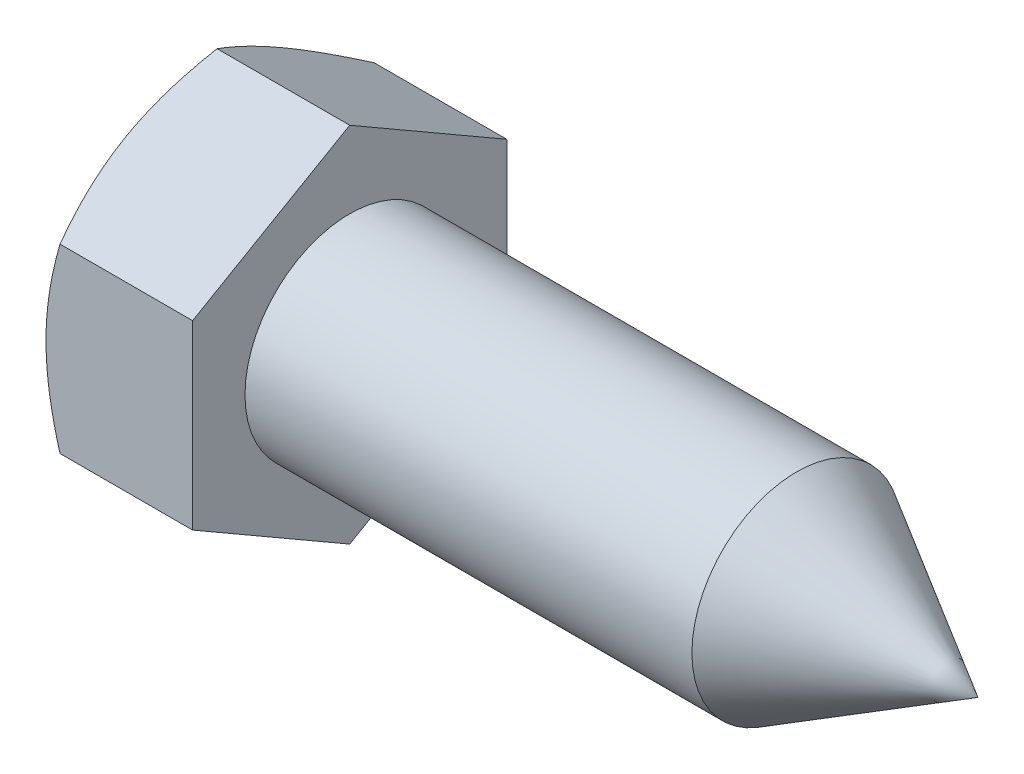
ISO-10303-21;
HEADER;
FILE_DESCRIPTION(('STEP AP214'),'2;1');
FILE_NAME('part.step','',(''),(''),'','','');
FILE_SCHEMA(('AUTOMOTIVE_DESIGN { 1 0 10303 214 1 1 1 1 }'));
ENDSEC;
DATA;
#1=APPLICATION_CONTEXT('core data for automotive mechanical design processes');
#2=APPLICATION_PROTOCOL_DEFINITION('international standard','automotive_design',2000,#1);
#3=PRODUCT_CONTEXT('',#1,'mechanical');
#4=PRODUCT('Part','Part','',(#3));
#5=PRODUCT_RELATED_PRODUCT_CATEGORY('part','',(#4));
#6=PRODUCT_DEFINITION_FORMATION('','',#4);
#7=PRODUCT_DEFINITION_CONTEXT('part definition',#1,'design');
#8=PRODUCT_DEFINITION('design','',#6,#7);
#9=PRODUCT_DEFINITION_SHAPE('','',#8);
#10=(LENGTH_UNIT() NAMED_UNIT(*) SI_UNIT(.MILLI.,.METRE.));
#11=(NAMED_UNIT(*) PLANE_ANGLE_UNIT() SI_UNIT($,.RADIAN.));
#12=(NAMED_UNIT(*) SI_UNIT($,.STERADIAN.) SOLID_ANGLE_UNIT());
#13=UNCERTAINTY_MEASURE_WITH_UNIT(LENGTH_MEASURE(1.E-05),#10,'distance_accuracy_value','');
#14=(GEOMETRIC_REPRESENTATION_CONTEXT(3) GLOBAL_UNCERTAINTY_ASSIGNED_CONTEXT((#13)) GLOBAL_UNIT_ASSIGNED_CONTEXT((#10,
#11,#12)) REPRESENTATION_CONTEXT('',''));
#15=CARTESIAN_POINT('',(0.,0.,0.));
#16=DIRECTION('',(0.,0.,1.));
#17=DIRECTION('',(1.,0.,0.));
#18=AXIS2_PLACEMENT_3D('',#15,#16,#17);
#19=CARTESIAN_POINT('',(17.78,10.9985226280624,-19.05));
#20=DIRECTION('',(0.,-0.866025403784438,0.500000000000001));
#21=DIRECTION('',(0.,-0.500000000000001,-0.866025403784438));
#22=AXIS2_PLACEMENT_3D('',#19,#20,#21);
#23=PLANE('',#22);
#24=CARTESIAN_POINT('',(1.70154403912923,21.9971607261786,0.000200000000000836));
#25=CARTESIAN_POINT('',(1.56198341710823,21.7554177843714,-0.41851105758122));
#26=CARTESIAN_POINT('',(1.42875584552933,21.5127319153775,-0.838855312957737));
#27=CARTESIAN_POINT('',(1.17672716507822,21.0254141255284,-1.68291448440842));
#28=CARTESIAN_POINT('',(1.05793080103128,20.7807815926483,-2.10663046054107));
#29=CARTESIAN_POINT('',(0.836361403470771,20.2890976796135,-2.95825197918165));
#30=CARTESIAN_POINT('',(0.733626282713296,20.0420419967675,-3.38616497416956));
#31=CARTESIAN_POINT('',(0.546385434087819,19.5462139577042,-4.24496432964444));
#32=CARTESIAN_POINT('',(0.461878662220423,19.2974417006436,-4.67585051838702));
#33=CARTESIAN_POINT('',(0.314688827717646,18.8045548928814,-5.5295555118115));
#34=CARTESIAN_POINT('',(0.251518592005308,18.5604769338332,-5.95231093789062));
#35=CARTESIAN_POINT('',(0.145596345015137,18.0712026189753,-6.79975891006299));
#36=CARTESIAN_POINT('',(0.102844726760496,17.8260062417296,-7.22445149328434));
#37=CARTESIAN_POINT('',(0.0388391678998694,17.3352016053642,-8.07455006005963));
#38=CARTESIAN_POINT('',(0.0175596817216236,17.0895941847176,-8.49995459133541));
#39=CARTESIAN_POINT('',(-0.003043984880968,16.5981526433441,-9.3511563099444));
#40=CARTESIAN_POINT('',(-0.00236884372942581,16.3523185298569,-9.77695348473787));
#41=CARTESIAN_POINT('',(0.0194033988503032,15.8927264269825,-10.5729903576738));
#42=CARTESIAN_POINT('',(0.0378455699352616,15.6789356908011,-10.9432867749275));
#43=CARTESIAN_POINT('',(0.0909844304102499,15.2518641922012,-11.6829963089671));
#44=CARTESIAN_POINT('',(0.125680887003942,15.0385834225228,-12.0524094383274));
#45=CARTESIAN_POINT('',(0.210726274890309,14.612612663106,-12.7902124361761));
#46=CARTESIAN_POINT('',(0.261089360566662,14.3999233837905,-13.1586010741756));
#47=CARTESIAN_POINT('',(0.376579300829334,13.9755573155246,-13.8936246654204));
#48=CARTESIAN_POINT('',(0.441706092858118,13.7638805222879,-14.2602596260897));
#49=CARTESIAN_POINT('',(0.660888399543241,13.121308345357,-15.3732272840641));
#50=CARTESIAN_POINT('',(0.836799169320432,12.6922737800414,-16.116336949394));
#51=CARTESIAN_POINT('',(1.23604434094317,11.840601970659,-17.5914757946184));
#52=CARTESIAN_POINT('',(1.4592849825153,11.4179538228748,-18.3235238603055));
#53=CARTESIAN_POINT('',(1.70154403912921,10.9984071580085,-19.0502));
#54=B_SPLINE_CURVE_WITH_KNOTS('',3,(#24,#25,#26,#27,#28,#29,#30,#31,#32,#33,#34,#35,#36,#37,#38,
#39,#40,#41,#42,#43,#44,#45,#46,#47,#48,#49,#50,#51,#52,#53),.UNSPECIFIED.,.F.,.F.,(4,2,2,2,2,2,
2,2,2,2,2,2,2,2,4),(0.,1.50971559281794,3.01992622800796,4.53364959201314,6.04728623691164,
7.52356313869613,8.99986845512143,10.4744153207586,11.9489166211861,13.2325441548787,
14.5161533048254,15.8009255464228,17.085692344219,19.7118183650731,22.3327898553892),.UNSPECIFIED.);
#55=CARTESIAN_POINT('',(1.70147737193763,21.9970452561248,0.));
#56=VERTEX_POINT('',#55);
#57=CARTESIAN_POINT('',(0.,16.4977839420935,-9.52500000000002));
#58=VERTEX_POINT('',#57);
#59=EDGE_CURVE('E59',#56,#58,#54,.T.);
#60=ORIENTED_EDGE('',*,*,#59,.F.);
#61=DIRECTION('',(-1.,0.,0.));
#62=VECTOR('',#61,1.);
#63=CARTESIAN_POINT('',(17.78,21.9970452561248,0.));
#64=LINE('',#63,#62);
#65=CARTESIAN_POINT('',(17.78,21.9970452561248,0.));
#66=VERTEX_POINT('',#65);
#67=EDGE_CURVE('E170',#66,#56,#64,.T.);
#68=ORIENTED_EDGE('',*,*,#67,.F.);
#69=DIRECTION('',(0.,0.500000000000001,0.866025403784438));
#70=VECTOR('',#69,1.);
#71=CARTESIAN_POINT('',(17.78,10.9985226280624,-19.05));
#72=LINE('',#71,#70);
#73=CARTESIAN_POINT('',(17.78,10.9985226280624,-19.05));
#74=VERTEX_POINT('',#73);
#75=EDGE_CURVE('E290',#74,#66,#72,.T.);
#76=ORIENTED_EDGE('',*,*,#75,.F.);
#77=DIRECTION('',(-1.,0.,0.));
#78=VECTOR('',#77,1.);
#79=CARTESIAN_POINT('',(17.78,10.9985226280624,-19.05));
#80=LINE('',#79,#78);
#81=CARTESIAN_POINT('',(1.70147737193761,10.9985226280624,-19.05));
#82=VERTEX_POINT('',#81);
#83=EDGE_CURVE('E147',#74,#82,#80,.T.);
#84=ORIENTED_EDGE('',*,*,#83,.T.);
#85=EDGE_CURVE('E142',#58,#82,#54,.T.);
#86=ORIENTED_EDGE('',*,*,#85,.F.);
#87=EDGE_LOOP('',(#60,#68,#76,#84,#86));
#88=FACE_BOUND('',#87,.T.);
#89=ADVANCED_FACE('F41',(#88),#23,.F.);
#90=CARTESIAN_POINT('',(17.78,21.9970452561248,0.));
#91=DIRECTION('',(0.,-0.866025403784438,-0.500000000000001));
#92=DIRECTION('',(0.,0.500000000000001,-0.866025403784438));
#93=AXIS2_PLACEMENT_3D('',#90,#91,#92);
#94=PLANE('',#93);
#95=CARTESIAN_POINT('',(1.70154403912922,10.9984071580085,19.0502));
#96=CARTESIAN_POINT('',(1.56198341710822,11.2401500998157,18.6314889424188));
#97=CARTESIAN_POINT('',(1.42875584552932,11.4828359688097,18.2111446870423));
#98=CARTESIAN_POINT('',(1.17672716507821,11.9701537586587,17.3670855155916));
#99=CARTESIAN_POINT('',(1.05793080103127,12.2147862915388,16.9433695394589));
#100=CARTESIAN_POINT('',(0.836361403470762,12.7064702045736,16.0917480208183));
#101=CARTESIAN_POINT('',(0.733626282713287,12.9535258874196,15.6638350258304));
#102=CARTESIAN_POINT('',(0.546385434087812,13.4493539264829,14.8050356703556));
#103=CARTESIAN_POINT('',(0.461878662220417,13.6981261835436,14.374149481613));
#104=CARTESIAN_POINT('',(0.314688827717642,14.1910129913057,13.5204444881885));
#105=CARTESIAN_POINT('',(0.251518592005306,14.4350909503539,13.0976890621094));
#106=CARTESIAN_POINT('',(0.145596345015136,14.9243652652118,12.250241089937));
#107=CARTESIAN_POINT('',(0.102844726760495,15.1695616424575,11.8255485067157));
#108=CARTESIAN_POINT('',(0.0388391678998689,15.6603662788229,10.9754499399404));
#109=CARTESIAN_POINT('',(0.0175596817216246,15.9059736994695,10.5500454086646));
#110=CARTESIAN_POINT('',(-0.00304398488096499,16.397415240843,9.69884369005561));
#111=CARTESIAN_POINT('',(-0.00236884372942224,16.6432493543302,9.27304651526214));
#112=CARTESIAN_POINT('',(0.0194033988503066,17.1028414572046,8.47700964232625));
#113=CARTESIAN_POINT('',(0.0378455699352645,17.316632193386,8.10671322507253));
#114=CARTESIAN_POINT('',(0.0909844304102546,17.7437036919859,7.36700369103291));
#115=CARTESIAN_POINT('',(0.125680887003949,17.9569844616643,6.99759056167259));
#116=CARTESIAN_POINT('',(0.210726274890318,18.3829552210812,6.25978756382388));
#117=CARTESIAN_POINT('',(0.26108936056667,18.5956445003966,5.89139892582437));
#118=CARTESIAN_POINT('',(0.376579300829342,19.0200105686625,5.15637533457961));
#119=CARTESIAN_POINT('',(0.441706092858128,19.2316873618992,4.7897403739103));
#120=CARTESIAN_POINT('',(0.660888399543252,19.8742595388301,3.67677271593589));
#121=CARTESIAN_POINT('',(0.836799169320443,20.3032941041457,2.93366305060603));
#122=CARTESIAN_POINT('',(1.23604434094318,21.1549659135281,1.45852420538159));
#123=CARTESIAN_POINT('',(1.45928498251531,21.5776140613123,0.726476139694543));
#124=CARTESIAN_POINT('',(1.70154403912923,21.9971607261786,-0.000199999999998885));
#125=B_SPLINE_CURVE_WITH_KNOTS('',3,(#95,#96,#97,#98,#99,#100,#101,#102,#103,#104,#105,#106,
#107,#108,#109,#110,#111,#112,#113,#114,#115,#116,#117,#118,#119,#120,#121,#122,#123,#124),
.UNSPECIFIED.,.F.,.F.,(4,2,2,2,2,2,2,2,2,2,2,2,2,2,4),(0.,1.50971559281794,3.01992622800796,
4.53364959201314,6.04728623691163,7.52356313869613,8.99986845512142,10.4744153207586,
11.9489166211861,13.2325441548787,14.5161533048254,15.8009255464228,17.085692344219,
19.7118183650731,22.3327898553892),.UNSPECIFIED.);
#126=CARTESIAN_POINT('',(1.70147737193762,10.9985226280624,19.05));
#127=VERTEX_POINT('',#126);
#128=CARTESIAN_POINT('',(0.,16.4977839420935,9.52500000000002));
#129=VERTEX_POINT('',#128);
#130=EDGE_CURVE('E61',#127,#129,#125,.T.);
#131=ORIENTED_EDGE('',*,*,#130,.F.);
#132=DIRECTION('',(-1.,0.,0.));
#133=VECTOR('',#132,1.);
#134=CARTESIAN_POINT('',(17.78,10.9985226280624,19.05));
#135=LINE('',#134,#133);
#136=CARTESIAN_POINT('',(17.78,10.9985226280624,19.05));
#137=VERTEX_POINT('',#136);
#138=EDGE_CURVE('E165',#137,#127,#135,.T.);
#139=ORIENTED_EDGE('',*,*,#138,.F.);
#140=DIRECTION('',(0.,-0.500000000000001,0.866025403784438));
#141=VECTOR('',#140,1.);
#142=CARTESIAN_POINT('',(17.78,21.9970452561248,0.));
#143=LINE('',#142,#141);
#144=EDGE_CURVE('E283',#66,#137,#143,.T.);
#145=ORIENTED_EDGE('',*,*,#144,.F.);
#146=ORIENTED_EDGE('',*,*,#67,.T.);
#147=EDGE_CURVE('E198',#129,#56,#125,.T.);
#148=ORIENTED_EDGE('',*,*,#147,.F.);
#149=EDGE_LOOP('',(#131,#139,#145,#146,#148));
#150=FACE_BOUND('',#149,.T.);
#151=ADVANCED_FACE('F207',(#150),#94,.F.);
#152=CARTESIAN_POINT('',(17.78,10.9985226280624,19.05));
#153=DIRECTION('',(0.,0.,-1.));
#154=DIRECTION('',(-1.,0.,0.));
#155=AXIS2_PLACEMENT_3D('',#152,#153,#154);
#156=PLANE('',#155);
#157=CARTESIAN_POINT('',(9.36387045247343,-29.681284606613,19.05));
#158=CARTESIAN_POINT('',(9.16146582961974,-29.264706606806,19.05));
#159=CARTESIAN_POINT('',(8.96006010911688,-28.8476434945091,19.05));
#160=CARTESIAN_POINT('',(8.55947242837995,-28.0124458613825,19.05));
#161=CARTESIAN_POINT('',(8.36029049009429,-27.5943113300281,19.05));
#162=CARTESIAN_POINT('',(7.76636768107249,-26.3380393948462,19.05));
#163=CARTESIAN_POINT('',(7.37530881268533,-25.4981547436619,19.05));
#164=CARTESIAN_POINT('',(6.60327220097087,-23.808305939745,19.05));
#165=CARTESIAN_POINT('',(6.22235974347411,-22.9583118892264,19.05));
#166=CARTESIAN_POINT('',(5.47593301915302,-21.2516124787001,19.05));
#167=CARTESIAN_POINT('',(5.11041803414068,-20.3949074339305,19.05));
#168=CARTESIAN_POINT('',(4.38719116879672,-18.6452025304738,19.05));
#169=CARTESIAN_POINT('',(4.03012757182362,-17.7519333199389,19.05));
#170=CARTESIAN_POINT('',(3.34269044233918,-15.9549889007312,19.05));
#171=CARTESIAN_POINT('',(3.01231988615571,-15.0513125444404,19.05));
#172=CARTESIAN_POINT('',(2.38684616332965,-13.2337927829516,19.05));
#173=CARTESIAN_POINT('',(2.09167277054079,-12.3199737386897,19.05));
#174=CARTESIAN_POINT('',(1.54595671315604,-10.4791413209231,19.05));
#175=CARTESIAN_POINT('',(1.29540013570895,-9.5521321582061,19.05));
#176=CARTESIAN_POINT('',(0.962715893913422,-8.15413474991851,19.05));
#177=CARTESIAN_POINT('',(0.859241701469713,-7.68819648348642,19.05));
#178=CARTESIAN_POINT('',(0.667894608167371,-6.75311076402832,19.05));
#179=CARTESIAN_POINT('',(0.580021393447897,-6.28396337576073,19.05));
#180=CARTESIAN_POINT('',(0.421420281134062,-5.34278179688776,19.05));
#181=CARTESIAN_POINT('',(0.350691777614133,-4.87074770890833,19.05));
#182=CARTESIAN_POINT('',(0.227781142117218,-3.92425443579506,19.05));
#183=CARTESIAN_POINT('',(0.175598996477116,-3.44979525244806,19.05));
#184=CARTESIAN_POINT('',(0.0914843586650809,-2.50539642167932,19.05));
#185=CARTESIAN_POINT('',(0.0592932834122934,-2.03547994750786,19.05));
#186=CARTESIAN_POINT('',(0.0148196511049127,-1.09470720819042,19.05));
#187=CARTESIAN_POINT('',(0.00253675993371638,-0.623850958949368,19.05));
#188=CARTESIAN_POINT('',(-0.00182781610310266,0.317959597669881,19.05));
#189=CARTESIAN_POINT('',(0.00609054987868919,0.788913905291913,19.05));
#190=CARTESIAN_POINT('',(0.0419336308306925,1.73006593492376,19.05));
#191=CARTESIAN_POINT('',(0.0698592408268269,2.20026362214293,19.05));
#192=CARTESIAN_POINT('',(0.160085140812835,3.32615149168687,19.05));
#193=CARTESIAN_POINT('',(0.231647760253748,3.9811127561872,19.05));
#194=CARTESIAN_POINT('',(0.409728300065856,5.2862687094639,19.05));
#195=CARTESIAN_POINT('',(0.516250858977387,5.93646275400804,19.05));
#196=CARTESIAN_POINT('',(0.76046212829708,7.23143263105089,19.05));
#197=CARTESIAN_POINT('',(0.898174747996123,7.87620391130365,19.05));
#198=CARTESIAN_POINT('',(1.20055584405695,9.159324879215,19.05));
#199=CARTESIAN_POINT('',(1.36522394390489,9.79767465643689,19.05));
#200=CARTESIAN_POINT('',(1.7214113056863,11.0820581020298,19.05));
#201=CARTESIAN_POINT('',(1.91344522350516,11.7279480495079,19.05));
#202=CARTESIAN_POINT('',(2.31762854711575,13.0133672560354,19.05));
#203=CARTESIAN_POINT('',(2.52977808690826,13.6528964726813,19.05));
#204=CARTESIAN_POINT('',(2.97080026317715,14.9259053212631,19.05));
#205=CARTESIAN_POINT('',(3.19966751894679,15.5593868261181,19.05));
#206=CARTESIAN_POINT('',(3.67140574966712,16.8210826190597,19.05));
#207=CARTESIAN_POINT('',(3.91427655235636,17.4492969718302,19.05));
#208=CARTESIAN_POINT('',(4.50783243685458,18.9429543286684,19.05));
#209=CARTESIAN_POINT('',(4.86391009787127,19.8062512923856,19.05));
#210=CARTESIAN_POINT('',(5.59369975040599,21.5253820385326,19.05));
#211=CARTESIAN_POINT('',(5.96741288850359,22.3812153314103,19.05));
#212=CARTESIAN_POINT('',(6.72890710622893,24.0868250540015,19.05));
#213=CARTESIAN_POINT('',(7.11669148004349,24.9366000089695,19.05));
#214=CARTESIAN_POINT('',(7.90345923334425,26.63091294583,19.05));
#215=CARTESIAN_POINT('',(8.3024423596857,27.4754510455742,19.05));
#216=CARTESIAN_POINT('',(9.1099521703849,29.161125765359,19.05));
#217=CARTESIAN_POINT('',(9.51848919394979,30.0022574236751,19.05));
#218=CARTESIAN_POINT('',(10.3430229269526,31.6808559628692,19.05));
#219=CARTESIAN_POINT('',(10.7590196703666,32.518322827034,19.05));
#220=CARTESIAN_POINT('',(11.5971269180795,34.1900490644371,19.05));
#221=CARTESIAN_POINT('',(12.0192366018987,35.0243088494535,19.05));
#222=CARTESIAN_POINT('',(12.8686125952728,36.690194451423,19.05));
#223=CARTESIAN_POINT('',(13.2958788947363,37.5218202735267,19.05));
#224=CARTESIAN_POINT('',(14.510917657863,39.8716762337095,19.05));
#225=CARTESIAN_POINT('',(15.3037675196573,41.3872809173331,19.05));
#226=CARTESIAN_POINT('',(16.9002701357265,44.4128482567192,19.05));
#227=CARTESIAN_POINT('',(17.7039232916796,45.9228107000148,19.05));
#228=CARTESIAN_POINT('',(19.3174048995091,48.9344252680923,19.05));
#229=CARTESIAN_POINT('',(20.1272121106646,50.4360887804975,19.05));
#230=CARTESIAN_POINT('',(21.3467150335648,52.6859282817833,19.05));
#231=CARTESIAN_POINT('',(21.7540032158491,53.4354111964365,19.05));
#232=CARTESIAN_POINT('',(22.5700166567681,54.9335928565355,19.05));
#233=CARTESIAN_POINT('',(22.9787419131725,55.6822916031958,19.05));
#234=CARTESIAN_POINT('',(23.3881024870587,56.4306429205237,19.05));
#235=B_SPLINE_CURVE_WITH_KNOTS('',3,(#157,#158,#159,#160,#161,#162,#163,#164,#165,#166,#167,
#168,#169,#170,#171,#172,#173,#174,#175,#176,#177,#178,#179,#180,#181,#182,#183,#184,#185,#186,
#187,#188,#189,#190,#191,#192,#193,#194,#195,#196,#197,#198,#199,#200,#201,#202,#203,#204,#205,
#206,#207,#208,#209,#210,#211,#212,#213,#214,#215,#216,#217,#218,#219,#220,#221,#222,#223,#224,
#225,#226,#227,#228,#229,#230,#231,#232,#233,#234),.UNSPECIFIED.,.F.,.F.,(4,2,2,2,2,2,2,2,2,2,2,
2,2,2,2,2,2,2,2,2,2,2,2,2,2,2,2,2,2,2,2,2,2,2,2,2,2,2,4),(0.,1.38943761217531,2.77888892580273,
5.55819563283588,8.35240254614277,11.1464789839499,14.0321224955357,16.9180873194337,
19.7981940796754,22.6774011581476,24.1090510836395,25.5406722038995,26.9722427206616,
28.4038121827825,29.8164561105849,31.2290763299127,32.6417001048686,34.0543870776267,
36.0298747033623,38.0056245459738,39.9828940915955,41.9601360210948,43.9812438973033,
46.0023652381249,48.0228389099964,50.0432877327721,52.8445655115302,55.6460256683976,
58.4481459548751,61.2502029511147,64.0554471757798,66.8607041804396,69.665588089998,
72.470466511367,77.6017760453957,82.7332768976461,87.8515588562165,90.4105564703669,
92.969550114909),.UNSPECIFIED.);
#236=CARTESIAN_POINT('',(1.70147737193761,-10.9985226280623,19.05));
#237=VERTEX_POINT('',#236);
#238=CARTESIAN_POINT('',(0.,0.,19.05));
#239=VERTEX_POINT('',#238);
#240=EDGE_CURVE('E298',#237,#239,#235,.T.);
#241=ORIENTED_EDGE('',*,*,#240,.F.);
#242=DIRECTION('',(-1.,0.,0.));
#243=VECTOR('',#242,1.);
#244=CARTESIAN_POINT('',(17.78,-10.9985226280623,19.05));
#245=LINE('',#244,#243);
#246=CARTESIAN_POINT('',(17.78,-10.9985226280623,19.05));
#247=VERTEX_POINT('',#246);
#248=EDGE_CURVE('E153',#247,#237,#245,.T.);
#249=ORIENTED_EDGE('',*,*,#248,.F.);
#250=DIRECTION('',(0.,-1.,0.));
#251=VECTOR('',#250,1.);
#252=CARTESIAN_POINT('',(17.78,10.9985226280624,19.05));
#253=LINE('',#252,#251);
#254=EDGE_CURVE('E280',#137,#247,#253,.T.);
#255=ORIENTED_EDGE('',*,*,#254,.F.);
#256=ORIENTED_EDGE('',*,*,#138,.T.);
#257=EDGE_CURVE('E227',#239,#127,#235,.T.);
#258=ORIENTED_EDGE('',*,*,#257,.F.);
#259=EDGE_LOOP('',(#241,#249,#255,#256,#258));
#260=FACE_BOUND('',#259,.T.);
#261=ADVANCED_FACE('F310',(#260),#156,.F.);
#262=CARTESIAN_POINT('',(17.78,-21.9970452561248,0.));
#263=DIRECTION('',(0.,0.866025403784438,-0.500000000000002));
#264=DIRECTION('',(0.,0.500000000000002,0.866025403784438));
#265=AXIS2_PLACEMENT_3D('',#262,#263,#264);
#266=PLANE('',#265);
#267=CARTESIAN_POINT('',(1.70154403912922,-21.9971607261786,-0.000200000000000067));
#268=CARTESIAN_POINT('',(1.56198341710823,-21.7554177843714,0.418511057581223));
#269=CARTESIAN_POINT('',(1.42875584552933,-21.5127319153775,0.838855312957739));
#270=CARTESIAN_POINT('',(1.17672716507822,-21.0254141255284,1.68291448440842));
#271=CARTESIAN_POINT('',(1.05793080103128,-20.7807815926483,2.10663046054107));
#272=CARTESIAN_POINT('',(0.836361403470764,-20.2890976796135,2.95825197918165));
#273=CARTESIAN_POINT('',(0.733626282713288,-20.0420419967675,3.38616497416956));
#274=CARTESIAN_POINT('',(0.546385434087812,-19.5462139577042,4.24496432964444));
#275=CARTESIAN_POINT('',(0.461878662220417,-19.2974417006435,4.67585051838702));
#276=CARTESIAN_POINT('',(0.31468882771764,-18.8045548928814,5.5295555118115));
#277=CARTESIAN_POINT('',(0.251518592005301,-18.5604769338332,5.95231093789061));
#278=CARTESIAN_POINT('',(0.145596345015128,-18.0712026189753,6.79975891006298));
#279=CARTESIAN_POINT('',(0.102844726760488,-17.8260062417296,7.22445149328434));
#280=CARTESIAN_POINT('',(0.0388391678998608,-17.3352016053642,8.07455006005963));
#281=CARTESIAN_POINT('',(0.0175596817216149,-17.0895941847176,8.49995459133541));
#282=CARTESIAN_POINT('',(-0.00304398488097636,-16.5981526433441,9.35115630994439));
#283=CARTESIAN_POINT('',(-0.00236884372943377,-16.3523185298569,9.77695348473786));
#284=CARTESIAN_POINT('',(0.0194033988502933,-15.8927264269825,10.5729903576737));
#285=CARTESIAN_POINT('',(0.0378455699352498,-15.6789356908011,10.9432867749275));
#286=CARTESIAN_POINT('',(0.0909844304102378,-15.2518641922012,11.6829963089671));
#287=CARTESIAN_POINT('',(0.125680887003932,-15.0385834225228,12.0524094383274));
#288=CARTESIAN_POINT('',(0.210726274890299,-14.6126126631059,12.7902124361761));
#289=CARTESIAN_POINT('',(0.261089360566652,-14.3999233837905,13.1586010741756));
#290=CARTESIAN_POINT('',(0.376579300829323,-13.9755573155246,13.8936246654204));
#291=CARTESIAN_POINT('',(0.441706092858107,-13.7638805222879,14.2602596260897));
#292=CARTESIAN_POINT('',(0.660888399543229,-13.121308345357,15.3732272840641));
#293=CARTESIAN_POINT('',(0.836799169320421,-12.6922737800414,16.116336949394));
#294=CARTESIAN_POINT('',(1.23604434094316,-11.840601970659,17.5914757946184));
#295=CARTESIAN_POINT('',(1.45928498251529,-11.4179538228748,18.3235238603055));
#296=CARTESIAN_POINT('',(1.7015440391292,-10.9984071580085,19.0502));
#297=B_SPLINE_CURVE_WITH_KNOTS('',3,(#267,#268,#269,#270,#271,#272,#273,#274,#275,#276,#277,
#278,#279,#280,#281,#282,#283,#284,#285,#286,#287,#288,#289,#290,#291,#292,#293,#294,#295,#296),
.UNSPECIFIED.,.F.,.F.,(4,2,2,2,2,2,2,2,2,2,2,2,2,2,4),(0.,1.50971559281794,3.01992622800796,
4.53364959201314,6.04728623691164,7.52356313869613,8.99986845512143,10.4744153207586,
11.9489166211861,13.2325441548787,14.5161533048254,15.8009255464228,17.085692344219,
19.7118183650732,22.3327898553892),.UNSPECIFIED.);
#298=CARTESIAN_POINT('',(1.70147737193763,-21.9970452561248,0.));
#299=VERTEX_POINT('',#298);
#300=CARTESIAN_POINT('',(0.,-16.4977839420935,9.52500000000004));
#301=VERTEX_POINT('',#300);
#302=EDGE_CURVE('E209',#299,#301,#297,.T.);
#303=ORIENTED_EDGE('',*,*,#302,.F.);
#304=DIRECTION('',(-1.,0.,0.));
#305=VECTOR('',#304,1.);
#306=CARTESIAN_POINT('',(17.78,-21.9970452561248,0.));
#307=LINE('',#306,#305);
#308=CARTESIAN_POINT('',(17.78,-21.9970452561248,0.));
#309=VERTEX_POINT('',#308);
#310=EDGE_CURVE('E149',#309,#299,#307,.T.);
#311=ORIENTED_EDGE('',*,*,#310,.F.);
#312=DIRECTION('',(0.,-0.500000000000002,-0.866025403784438));
#313=VECTOR('',#312,1.);
#314=CARTESIAN_POINT('',(17.78,-21.9970452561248,0.));
#315=LINE('',#314,#313);
#316=EDGE_CURVE('E273',#247,#309,#315,.T.);
#317=ORIENTED_EDGE('',*,*,#316,.F.);
#318=ORIENTED_EDGE('',*,*,#248,.T.);
#319=EDGE_CURVE('E212',#301,#237,#297,.T.);
#320=ORIENTED_EDGE('',*,*,#319,.F.);
#321=EDGE_LOOP('',(#303,#311,#317,#318,#320));
#322=FACE_BOUND('',#321,.T.);
#323=ADVANCED_FACE('F272',(#322),#266,.F.);
#324=CARTESIAN_POINT('',(17.78,-10.9985226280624,-19.05));
#325=DIRECTION('',(0.,0.866025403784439,0.5));
#326=DIRECTION('',(0.,-0.5,0.866025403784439));
#327=AXIS2_PLACEMENT_3D('',#324,#325,#326);
#328=PLANE('',#327);
#329=CARTESIAN_POINT('',(1.70154403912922,-10.9984071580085,-19.0502));
#330=CARTESIAN_POINT('',(1.56198341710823,-11.2401500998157,-18.6314889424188));
#331=CARTESIAN_POINT('',(1.42875584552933,-11.4828359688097,-18.2111446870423));
#332=CARTESIAN_POINT('',(1.17672716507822,-11.9701537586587,-17.3670855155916));
#333=CARTESIAN_POINT('',(1.05793080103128,-12.2147862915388,-16.9433695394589));
#334=CARTESIAN_POINT('',(0.836361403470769,-12.7064702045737,-16.0917480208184));
#335=CARTESIAN_POINT('',(0.733626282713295,-12.9535258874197,-15.6638350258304));
#336=CARTESIAN_POINT('',(0.54638543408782,-13.449353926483,-14.8050356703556));
#337=CARTESIAN_POINT('',(0.461878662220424,-13.6981261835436,-14.374149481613));
#338=CARTESIAN_POINT('',(0.314688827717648,-14.1910129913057,-13.5204444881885));
#339=CARTESIAN_POINT('',(0.251518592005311,-14.4350909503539,-13.0976890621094));
#340=CARTESIAN_POINT('',(0.145596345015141,-14.9243652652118,-12.250241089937));
#341=CARTESIAN_POINT('',(0.1028447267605,-15.1695616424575,-11.8255485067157));
#342=CARTESIAN_POINT('',(0.0388391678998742,-15.6603662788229,-10.9754499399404));
#343=CARTESIAN_POINT('',(0.01755968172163,-15.9059736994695,-10.5500454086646));
#344=CARTESIAN_POINT('',(-0.00304398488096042,-16.3974152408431,-9.6988436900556));
#345=CARTESIAN_POINT('',(-0.00236884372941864,-16.6432493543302,-9.27304651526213));
#346=CARTESIAN_POINT('',(0.01940339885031,-17.1028414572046,-8.47700964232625));
#347=CARTESIAN_POINT('',(0.0378455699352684,-17.316632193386,-8.10671322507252));
#348=CARTESIAN_POINT('',(0.0909844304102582,-17.7437036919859,-7.36700369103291));
#349=CARTESIAN_POINT('',(0.125680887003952,-17.9569844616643,-6.99759056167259));
#350=CARTESIAN_POINT('',(0.210726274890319,-18.3829552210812,-6.25978756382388));
#351=CARTESIAN_POINT('',(0.261089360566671,-18.5956445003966,-5.89139892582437));
#352=CARTESIAN_POINT('',(0.376579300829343,-19.0200105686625,-5.15637533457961));
#353=CARTESIAN_POINT('',(0.441706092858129,-19.2316873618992,-4.78974037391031));
#354=CARTESIAN_POINT('',(0.660888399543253,-19.8742595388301,-3.6767727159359));
#355=CARTESIAN_POINT('',(0.836799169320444,-20.3032941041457,-2.93366305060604));
#356=CARTESIAN_POINT('',(1.23604434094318,-21.1549659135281,-1.45852420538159));
#357=CARTESIAN_POINT('',(1.45928498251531,-21.5776140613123,-0.726476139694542));
#358=CARTESIAN_POINT('',(1.70154403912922,-21.9971607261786,0.000199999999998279));
#359=B_SPLINE_CURVE_WITH_KNOTS('',3,(#329,#330,#331,#332,#333,#334,#335,#336,#337,#338,#339,
#340,#341,#342,#343,#344,#345,#346,#347,#348,#349,#350,#351,#352,#353,#354,#355,#356,#357,#358),
.UNSPECIFIED.,.F.,.F.,(4,2,2,2,2,2,2,2,2,2,2,2,2,2,4),(0.,1.50971559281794,3.01992622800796,
4.53364959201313,6.04728623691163,7.52356313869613,8.99986845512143,10.4744153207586,
11.9489166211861,13.2325441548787,14.5161533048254,15.8009255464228,17.085692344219,
19.7118183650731,22.3327898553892),.UNSPECIFIED.);
#360=CARTESIAN_POINT('',(1.70147737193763,-10.9985226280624,-19.05));
#361=VERTEX_POINT('',#360);
#362=CARTESIAN_POINT('',(0.,-16.4977839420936,-9.525));
#363=VERTEX_POINT('',#362);
#364=EDGE_CURVE('E122',#361,#363,#359,.T.);
#365=ORIENTED_EDGE('',*,*,#364,.F.);
#366=DIRECTION('',(-1.,0.,0.));
#367=VECTOR('',#366,1.);
#368=CARTESIAN_POINT('',(17.78,-10.9985226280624,-19.05));
#369=LINE('',#368,#367);
#370=CARTESIAN_POINT('',(17.78,-10.9985226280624,-19.05));
#371=VERTEX_POINT('',#370);
#372=EDGE_CURVE('E138',#371,#361,#369,.T.);
#373=ORIENTED_EDGE('',*,*,#372,.F.);
#374=DIRECTION('',(0.,0.5,-0.866025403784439));
#375=VECTOR('',#374,1.);
#376=CARTESIAN_POINT('',(17.78,-10.9985226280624,-19.05));
#377=LINE('',#376,#375);
#378=EDGE_CURVE('E271',#309,#371,#377,.T.);
#379=ORIENTED_EDGE('',*,*,#378,.F.);
#380=ORIENTED_EDGE('',*,*,#310,.T.);
#381=EDGE_CURVE('E139',#363,#299,#359,.T.);
#382=ORIENTED_EDGE('',*,*,#381,.F.);
#383=EDGE_LOOP('',(#365,#373,#379,#380,#382));
#384=FACE_BOUND('',#383,.T.);
#385=ADVANCED_FACE('F133',(#384),#328,.F.);
#386=CARTESIAN_POINT('',(17.78,10.9985226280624,-19.05));
#387=DIRECTION('',(0.,0.,1.));
#388=DIRECTION('',(0.,-1.,0.));
#389=AXIS2_PLACEMENT_3D('',#386,#387,#388);
#390=PLANE('',#389);
#391=CARTESIAN_POINT('',(9.36387045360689,-29.6812846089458,-19.05));
#392=CARTESIAN_POINT('',(9.16146583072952,-29.2647066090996,-19.05));
#393=CARTESIAN_POINT('',(8.96006011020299,-28.8476434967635,-19.05));
#394=CARTESIAN_POINT('',(8.55947242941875,-28.0124458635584,-19.05));
#395=CARTESIAN_POINT('',(8.36029049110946,-27.5943113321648,-19.05));
#396=CARTESIAN_POINT('',(7.76636768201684,-26.338039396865,-19.05));
#397=CARTESIAN_POINT('',(7.37530881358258,-25.4981547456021,-19.05));
#398=CARTESIAN_POINT('',(6.60327220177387,-23.8083059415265,-19.05));
#399=CARTESIAN_POINT('',(6.22235974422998,-22.958311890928,-19.05));
#400=CARTESIAN_POINT('',(5.47593301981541,-21.2516124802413,-19.05));
#401=CARTESIAN_POINT('',(5.11041803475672,-20.3949074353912,-19.05));
#402=CARTESIAN_POINT('',(4.3871911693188,-18.6452025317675,-19.05));
#403=CARTESIAN_POINT('',(4.03012757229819,-17.751933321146,-19.05));
#404=CARTESIAN_POINT('',(3.34269044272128,-15.9549889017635,-19.05));
#405=CARTESIAN_POINT('',(3.01231988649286,-15.0513125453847,-19.05));
#406=CARTESIAN_POINT('',(2.38684616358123,-13.2337927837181,-19.05));
#407=CARTESIAN_POINT('',(2.09167277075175,-12.3199737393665,-19.05));
#408=CARTESIAN_POINT('',(1.54595671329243,-10.479141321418,-19.05));
#409=CARTESIAN_POINT('',(1.2954001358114,-9.55213215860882,-19.05));
#410=CARTESIAN_POINT('',(0.962715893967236,-8.15413475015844,-19.05));
#411=CARTESIAN_POINT('',(0.85924170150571,-7.68819648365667,-19.05));
#412=CARTESIAN_POINT('',(0.667894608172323,-6.75311076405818,-19.05));
#413=CARTESIAN_POINT('',(0.580021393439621,-6.2839633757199,-19.05));
#414=CARTESIAN_POINT('',(0.421420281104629,-5.34278179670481,-19.05));
#415=CARTESIAN_POINT('',(0.350691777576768,-4.87074770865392,-19.05));
#416=CARTESIAN_POINT('',(0.227781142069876,-3.92425443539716,-19.05));
#417=CARTESIAN_POINT('',(0.175598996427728,-3.44979525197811,-19.05));
#418=CARTESIAN_POINT('',(0.0914843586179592,-2.50539642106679,-19.05));
#419=CARTESIAN_POINT('',(0.0592932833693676,-2.03547994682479,-19.05));
#420=CARTESIAN_POINT('',(0.0148196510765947,-1.09470720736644,-19.05));
#421=CARTESIAN_POINT('',(0.00253675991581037,-0.623850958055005,-19.05));
#422=CARTESIAN_POINT('',(-0.00182781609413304,0.317959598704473,-19.05));
#423=CARTESIAN_POINT('',(0.00609054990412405,0.788913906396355,-19.05));
#424=CARTESIAN_POINT('',(0.0419336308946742,1.73006593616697,-19.05));
#425=CARTESIAN_POINT('',(0.0698592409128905,2.20026362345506,-19.05));
#426=CARTESIAN_POINT('',(0.160085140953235,3.32615149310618,-19.05));
#427=CARTESIAN_POINT('',(0.231647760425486,3.98111275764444,-19.05));
#428=CARTESIAN_POINT('',(0.409728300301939,5.28626871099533,-19.05));
#429=CARTESIAN_POINT('',(0.516250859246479,5.93646275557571,-19.05));
#430=CARTESIAN_POINT('',(0.760462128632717,7.23143263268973,-19.05));
#431=CARTESIAN_POINT('',(0.898174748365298,7.87620391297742,-19.05));
#432=CARTESIAN_POINT('',(1.20055584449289,9.15932488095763,-19.05));
#433=CARTESIAN_POINT('',(1.36522394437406,9.79767465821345,-19.05));
#434=CARTESIAN_POINT('',(1.72141130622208,11.0820581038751,-19.05));
#435=CARTESIAN_POINT('',(1.91344522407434,11.727948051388,-19.05));
#436=CARTESIAN_POINT('',(2.3176285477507,13.0133672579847,-19.05));
#437=CARTESIAN_POINT('',(2.52977808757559,13.6528964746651,-19.05));
#438=CARTESIAN_POINT('',(2.97080026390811,14.9259053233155,-19.05));
#439=CARTESIAN_POINT('',(3.19966751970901,15.5593868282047,-19.05));
#440=CARTESIAN_POINT('',(3.67140575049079,16.8210826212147,-19.05));
#441=CARTESIAN_POINT('',(3.91427655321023,17.4492969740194,-19.05));
#442=CARTESIAN_POINT('',(4.50783243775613,18.9429543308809,-19.05));
#443=CARTESIAN_POINT('',(4.86391009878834,19.8062512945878,-19.05));
#444=CARTESIAN_POINT('',(5.59369975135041,21.5253820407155,-19.05));
#445=CARTESIAN_POINT('',(5.96741288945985,22.3812153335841,-19.05));
#446=CARTESIAN_POINT('',(6.72890710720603,24.0868250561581,-19.05));
#447=CARTESIAN_POINT('',(7.1166914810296,24.936600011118,-19.05));
#448=CARTESIAN_POINT('',(7.90345923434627,26.630912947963,-19.05));
#449=CARTESIAN_POINT('',(8.3024423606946,27.4754510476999,-19.05));
#450=CARTESIAN_POINT('',(9.1099521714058,29.1611257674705,-19.05));
#451=CARTESIAN_POINT('',(9.5184891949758,30.0022574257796,-19.05));
#452=CARTESIAN_POINT('',(10.3430229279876,31.6808559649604,-19.05));
#453=CARTESIAN_POINT('',(10.7590196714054,32.5183228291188,-19.05));
#454=CARTESIAN_POINT('',(11.597126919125,34.1900490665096,-19.05));
#455=CARTESIAN_POINT('',(12.0192366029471,35.0243088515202,-19.05));
#456=CARTESIAN_POINT('',(12.868612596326,36.6901944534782,-19.05));
#457=CARTESIAN_POINT('',(13.2958788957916,37.5218202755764,-19.05));
#458=CARTESIAN_POINT('',(14.5109176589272,39.8716762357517,-19.05));
#459=CARTESIAN_POINT('',(15.3037675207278,41.3872809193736,-19.05));
#460=CARTESIAN_POINT('',(16.9002701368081,44.4128482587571,-19.05));
#461=CARTESIAN_POINT('',(17.703923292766,45.9228107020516,-19.05));
#462=CARTESIAN_POINT('',(19.3174049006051,48.934425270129,-19.05));
#463=CARTESIAN_POINT('',(20.1272121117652,50.436088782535,-19.05));
#464=CARTESIAN_POINT('',(21.3467150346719,52.6859282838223,-19.05));
#465=CARTESIAN_POINT('',(21.7540032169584,53.4354111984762,-19.05));
#466=CARTESIAN_POINT('',(22.5700166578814,54.9335928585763,-19.05));
#467=CARTESIAN_POINT('',(22.9787419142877,55.6822916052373,-19.05));
#468=CARTESIAN_POINT('',(23.3881024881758,56.4306429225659,-19.05));
#469=B_SPLINE_CURVE_WITH_KNOTS('',3,(#391,#392,#393,#394,#395,#396,#397,#398,#399,#400,#401,
#402,#403,#404,#405,#406,#407,#408,#409,#410,#411,#412,#413,#414,#415,#416,#417,#418,#419,#420,
#421,#422,#423,#424,#425,#426,#427,#428,#429,#430,#431,#432,#433,#434,#435,#436,#437,#438,#439,
#440,#441,#442,#443,#444,#445,#446,#447,#448,#449,#450,#451,#452,#453,#454,#455,#456,#457,#458,
#459,#460,#461,#462,#463,#464,#465,#466,#467,#468),.UNSPECIFIED.,.F.,.F.,(4,2,2,2,2,2,2,2,2,2,2,
2,2,2,2,2,2,2,2,2,2,2,2,2,2,2,2,2,2,2,2,2,2,2,2,2,2,2,4),(0.,1.38943761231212,2.77888892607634,
5.55819563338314,8.35240254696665,11.1464789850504,14.0321224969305,16.9180873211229,
19.7981940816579,22.6774011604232,24.1090510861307,25.5406722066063,26.9722427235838,
28.40381218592,29.8164561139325,31.2290763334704,32.6417001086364,34.0543870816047,
36.0298747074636,38.0056245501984,39.9828940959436,41.9601360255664,43.9812439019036,
46.0023652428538,48.0228389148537,50.0432877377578,52.8445655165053,55.646025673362,
58.4481459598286,61.2502029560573,64.0554471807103,66.8607041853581,69.6655880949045,
72.4704665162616,77.6017760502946,82.7332769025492,87.8515588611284,90.4105564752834,
92.96955011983),.UNSPECIFIED.);
#470=CARTESIAN_POINT('',(0.,0.,-19.05));
#471=VERTEX_POINT('',#470);
#472=EDGE_CURVE('E127',#82,#471,#469,.F.);
#473=ORIENTED_EDGE('',*,*,#472,.F.);
#474=ORIENTED_EDGE('',*,*,#83,.F.);
#475=DIRECTION('',(0.,1.,0.));
#476=VECTOR('',#475,1.);
#477=CARTESIAN_POINT('',(17.78,10.9985226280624,-19.05));
#478=LINE('',#477,#476);
#479=EDGE_CURVE('E143',#371,#74,#478,.T.);
#480=ORIENTED_EDGE('',*,*,#479,.F.);
#481=ORIENTED_EDGE('',*,*,#372,.T.);
#482=EDGE_CURVE('E117',#471,#361,#469,.F.);
#483=ORIENTED_EDGE('',*,*,#482,.F.);
#484=EDGE_LOOP('',(#473,#474,#480,#481,#483));
#485=FACE_BOUND('',#484,.T.);
#486=ADVANCED_FACE('F141',(#485),#390,.F.);
#487=CARTESIAN_POINT('',(17.78,21.9970452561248,0.));
#488=DIRECTION('',(1.,0.,0.));
#489=DIRECTION('',(0.,0.,-1.));
#490=AXIS2_PLACEMENT_3D('',#487,#488,#489);
#491=PLANE('',#490);
#492=CARTESIAN_POINT('',(17.78,0.,0.));
#493=DIRECTION('',(1.,0.,0.));
#494=DIRECTION('',(0.,0.,-1.));
#495=AXIS2_PLACEMENT_3D('',#492,#493,#494);
#496=CIRCLE('',#495,12.7);
#497=CARTESIAN_POINT('',(17.78,0.,-12.7));
#498=VERTEX_POINT('',#497);
#499=EDGE_CURVE('E287',#498,#498,#496,.F.);
#500=ORIENTED_EDGE('',*,*,#499,.T.);
#501=EDGE_LOOP('',(#500));
#502=FACE_BOUND('',#501,.T.);
#503=ORIENTED_EDGE('',*,*,#75,.T.);
#504=ORIENTED_EDGE('',*,*,#144,.T.);
#505=ORIENTED_EDGE('',*,*,#254,.T.);
#506=ORIENTED_EDGE('',*,*,#316,.T.);
#507=ORIENTED_EDGE('',*,*,#378,.T.);
#508=ORIENTED_EDGE('',*,*,#479,.T.);
#509=EDGE_LOOP('',(#503,#504,#505,#506,#507,#508));
#510=FACE_BOUND('',#509,.T.);
#511=ADVANCED_FACE('F307',(#502,#510),#491,.T.);
#512=CARTESIAN_POINT('',(0.,0.,0.));
#513=DIRECTION('',(-1.,0.,0.));
#514=DIRECTION('',(0.,0.,1.));
#515=AXIS2_PLACEMENT_3D('',#512,#513,#514);
#516=CYLINDRICAL_SURFACE('',#515,12.7);
#517=ORIENTED_EDGE('',*,*,#499,.F.);
#518=EDGE_LOOP('',(#517));
#519=FACE_BOUND('',#518,.T.);
#520=CARTESIAN_POINT('',(71.9829547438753,0.,0.));
#521=DIRECTION('',(-1.,0.,0.));
#522=DIRECTION('',(0.,0.,1.));
#523=AXIS2_PLACEMENT_3D('',#520,#521,#522);
#524=CIRCLE('',#523,12.7);
#525=CARTESIAN_POINT('',(71.9829547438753,0.,12.7));
#526=VERTEX_POINT('',#525);
#527=EDGE_CURVE('E291',#526,#526,#524,.T.);
#528=ORIENTED_EDGE('',*,*,#527,.T.);
#529=EDGE_LOOP('',(#528));
#530=FACE_BOUND('',#529,.T.);
#531=ADVANCED_FACE('F344',(#519,#530),#516,.T.);
#532=CARTESIAN_POINT('',(93.98,0.,0.));
#533=DIRECTION('',(-1.,0.,0.));
#534=DIRECTION('',(0.,0.,1.));
#535=AXIS2_PLACEMENT_3D('',#532,#533,#534);
#536=CONICAL_SURFACE('',#535,0.,0.5235987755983);
#537=ORIENTED_EDGE('',*,*,#527,.F.);
#538=EDGE_LOOP('',(#537));
#539=FACE_BOUND('',#538,.T.);
#540=CARTESIAN_POINT('',(93.98,0.,0.));
#541=VERTEX_POINT('',#540);
#542=VERTEX_LOOP('',#541);
#543=FACE_BOUND('',#542,.T.);
#544=ADVANCED_FACE('F241',(#539,#543),#536,.T.);
#545=CARTESIAN_POINT('',(0.,0.,0.));
#546=DIRECTION('',(1.,0.,0.));
#547=DIRECTION('',(0.,0.,-1.));
#548=AXIS2_PLACEMENT_3D('',#545,#546,#547);
#549=CONICAL_SURFACE('',#548,19.05,1.0471975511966);
#550=ORIENTED_EDGE('',*,*,#364,.T.);
#551=CARTESIAN_POINT('',(0.,0.,0.));
#552=DIRECTION('',(1.,0.,0.));
#553=DIRECTION('',(0.,0.,-1.));
#554=AXIS2_PLACEMENT_3D('',#551,#552,#553);
#555=CIRCLE('',#554,19.05);
#556=EDGE_CURVE('E44',#363,#471,#555,.T.);
#557=ORIENTED_EDGE('',*,*,#556,.T.);
#558=ORIENTED_EDGE('',*,*,#482,.T.);
#559=EDGE_LOOP('',(#550,#557,#558));
#560=FACE_BOUND('',#559,.T.);
#561=ADVANCED_FACE('F119',(#560),#549,.T.);
#562=ORIENTED_EDGE('',*,*,#302,.T.);
#563=EDGE_CURVE('E176',#301,#363,#555,.T.);
#564=ORIENTED_EDGE('',*,*,#563,.T.);
#565=ORIENTED_EDGE('',*,*,#381,.T.);
#566=EDGE_LOOP('',(#562,#564,#565));
#567=FACE_BOUND('',#566,.T.);
#568=ADVANCED_FACE('F239',(#567),#549,.T.);
#569=ORIENTED_EDGE('',*,*,#240,.T.);
#570=EDGE_CURVE('E177',#239,#301,#555,.T.);
#571=ORIENTED_EDGE('',*,*,#570,.T.);
#572=ORIENTED_EDGE('',*,*,#319,.T.);
#573=EDGE_LOOP('',(#569,#571,#572));
#574=FACE_BOUND('',#573,.T.);
#575=ADVANCED_FACE('F232',(#574),#549,.T.);
#576=ORIENTED_EDGE('',*,*,#257,.T.);
#577=ORIENTED_EDGE('',*,*,#130,.T.);
#578=CARTESIAN_POINT('',(0.,0.,0.));
#579=DIRECTION('',(-1.,0.,0.));
#580=DIRECTION('',(0.,0.,1.));
#581=AXIS2_PLACEMENT_3D('',#578,#579,#580);
#582=CIRCLE('',#581,19.05);
#583=EDGE_CURVE('E130',#239,#129,#582,.T.);
#584=ORIENTED_EDGE('',*,*,#583,.F.);
#585=EDGE_LOOP('',(#576,#577,#584));
#586=FACE_BOUND('',#585,.T.);
#587=ADVANCED_FACE('F237',(#586),#549,.T.);
#588=ORIENTED_EDGE('',*,*,#147,.T.);
#589=ORIENTED_EDGE('',*,*,#59,.T.);
#590=EDGE_CURVE('E51',#58,#129,#555,.T.);
#591=ORIENTED_EDGE('',*,*,#590,.T.);
#592=EDGE_LOOP('',(#588,#589,#591));
#593=FACE_BOUND('',#592,.T.);
#594=ADVANCED_FACE('F200',(#593),#549,.T.);
#595=ORIENTED_EDGE('',*,*,#85,.T.);
#596=ORIENTED_EDGE('',*,*,#472,.T.);
#597=EDGE_CURVE('E11',#471,#58,#555,.T.);
#598=ORIENTED_EDGE('',*,*,#597,.T.);
#599=EDGE_LOOP('',(#595,#596,#598));
#600=FACE_BOUND('',#599,.T.);
#601=ADVANCED_FACE('F313',(#600),#549,.T.);
#602=CARTESIAN_POINT('',(0.,21.9970452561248,0.));
#603=DIRECTION('',(1.,0.,0.));
#604=DIRECTION('',(0.,0.,-1.));
#605=AXIS2_PLACEMENT_3D('',#602,#603,#604);
#606=PLANE('',#605);
#607=ORIENTED_EDGE('',*,*,#597,.F.);
#608=ORIENTED_EDGE('',*,*,#556,.F.);
#609=ORIENTED_EDGE('',*,*,#563,.F.);
#610=ORIENTED_EDGE('',*,*,#570,.F.);
#611=ORIENTED_EDGE('',*,*,#583,.T.);
#612=ORIENTED_EDGE('',*,*,#590,.F.);
#613=EDGE_LOOP('',(#607,#608,#609,#610,#611,#612));
#614=FACE_BOUND('',#613,.T.);
#615=ADVANCED_FACE('F205',(#614),#606,.F.);
#616=CLOSED_SHELL('',(#89,#151,#261,#323,#385,#486,#511,#531,#544,#561,#568,#575,#587,#594,#601,#615));
#617=MANIFOLD_SOLID_BREP('B2',#616);
#618=ADVANCED_BREP_SHAPE_REPRESENTATION('',(#18,#617),#14);
#619=SHAPE_DEFINITION_REPRESENTATION(#9,#618);
ENDSEC;
END-ISO-10303-21;
